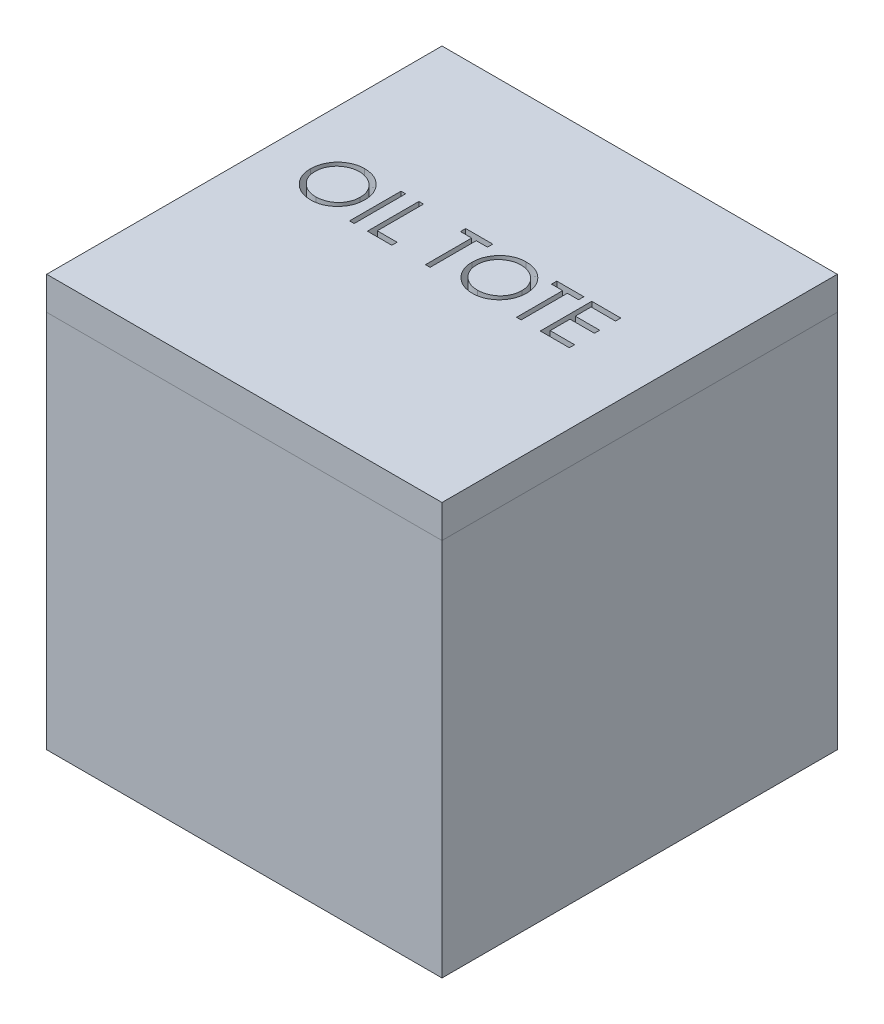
from build123d import *

# Parameters (mm, degrees)
SKETCH1_W           = 1219.2
SKETCH1_H           = 1219.2
BOSS_EXTRUDE1_DEPTH = 1168.4
SKETCH2_W           = 1219.2
SKETCH2_H           = 1219.2
BOSS_EXTRUDE2_DEPTH = 101.6
SKETCH3_W           = 14.246794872
SKETCH3_H           = 158.75
CUT_EXTRUDE1_DEPTH  = 101.6


with BuildPart() as part:
    # Sketch1 → Boss-Extrude1 (new body)
    with BuildSketch(Plane(origin=(0, 0, 0), x_dir=(1, 0, 0), z_dir=(0, 1, 0))):
        Rectangle(SKETCH1_W, SKETCH1_H)
    extrude(amount=BOSS_EXTRUDE1_DEPTH)


with BuildPart() as body_2:
    # Sketch2 → Boss-Extrude2 (new body)
    with BuildSketch(Plane(origin=(0, 1168.4, 0), x_dir=(1, 0, 0), z_dir=(0, 1, 0))):
        Rectangle(SKETCH2_W, SKETCH2_H)
    extrude(amount=BOSS_EXTRUDE2_DEPTH)

    # Sketch3 → Cut-Extrude1 (cut)
    # profile 1 of 7: a face of its own
    with BuildSketch(Plane(origin=(0, 1270, 0), x_dir=(1, 0, 0), z_dir=(0, 1, 0))):
        with BuildLine():
            add(Edge.make_bspline(
                [(-402.10480343, 162.820512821), (-399.165292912, 162.746060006), (-393.391851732, 162.599828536), (-384.906668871, 161.480454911), (-376.806105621, 159.543914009), (-369.024174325, 156.964771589), (-361.653957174, 153.524233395), (-354.639978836, 149.365657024), (-347.998927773, 144.445474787), (-341.820315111, 138.801720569), (-336.166232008, 132.66111391), (-331.184843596, 126.108008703), (-327.01006813, 119.182027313), (-323.581712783, 111.903982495), (-320.892097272, 104.290333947), (-319.036126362, 96.30049168), (-317.850574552, 87.986223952), (-317.711973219, 82.315362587), (-317.641662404, 79.438601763)],
                knots=[0, 0, 0, 0, 1.065120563, 2.091984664, 3.0946048, 4.079830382, 5.057816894, 6.036188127, 7.030412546, 8.04752943, 9.064399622, 10.05169764, 11.02544977, 11.989514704, 12.962713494, 13.945757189, 14.957906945, 16, 16, 16, 16], degree=3))
            add(Edge.make_bspline(
                [(-317.641662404, 79.438601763), (-317.711962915, 76.583031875), (-317.850533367, 70.954372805), (-319.037474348, 62.692866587), (-320.898976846, 54.751252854), (-323.556736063, 47.142789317), (-326.968748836, 39.859449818), (-331.171322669, 32.920398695), (-336.121656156, 26.32336109), (-341.755324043, 20.14060806), (-347.896728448, 14.471079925), (-354.483958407, 9.530830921), (-361.368869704, 5.279772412), (-368.640060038, 1.887798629), (-376.201097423, -0.823284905), (-384.119652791, -2.671707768), (-392.358621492, -3.864012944), (-397.977056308, -4.000924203), (-400.832768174, -4.070512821)],
                knots=[0, 0, 0, 0, 1.043624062, 2.057103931, 3.04512605, 4.022047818, 4.998200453, 5.980619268, 6.982898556, 8.009068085, 9.034988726, 10.034168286, 11.015286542, 11.987931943, 12.962482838, 13.94673481, 14.956375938, 16, 16, 16, 16], degree=3))
            add(Edge.make_bspline(
                [(-400.832768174, -4.070512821), (-403.70951407, -4.00023706), (-409.380346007, -3.861704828), (-417.705061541, -2.67419111), (-425.700516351, -0.817210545), (-433.343845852, 1.836610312), (-440.639312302, 5.266391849), (-447.60118391, 9.448519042), (-454.20151666, 14.410914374), (-460.385588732, 20.042755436), (-466.043855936, 26.173750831), (-470.976870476, 32.743018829), (-475.159938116, 39.621677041), (-478.578203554, 46.828814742), (-481.28441296, 54.329590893), (-483.130667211, 62.174039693), (-484.325190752, 70.317438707), (-484.462842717, 75.862027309), (-484.532688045, 78.675380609)],
                knots=[0, 0, 0, 0, 1.053102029, 2.075944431, 3.073151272, 4.055350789, 5.033113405, 6.020478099, 7.024410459, 8.052272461, 9.079885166, 10.07527673, 11.055994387, 12.023226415, 12.992069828, 13.970394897, 14.97016774, 16, 16, 16, 16], degree=3))
            add(Edge.make_bspline(
                [(-484.532688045, 78.675380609), (-484.508438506, 80.563719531), (-484.460245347, 84.316575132), (-483.880050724, 89.889453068), (-483.038144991, 95.372707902), (-481.831558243, 100.750747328), (-480.253507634, 106.010406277), (-478.391504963, 111.187958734), (-476.117304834, 116.230934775), (-473.546432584, 121.163224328), (-470.67705772, 125.907940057), (-467.50769337, 130.392835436), (-464.149660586, 134.655544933), (-460.468320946, 138.585605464), (-456.58500361, 142.297346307), (-452.436712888, 145.733726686), (-448.04876109, 148.92573339), (-443.402267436, 151.802298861), (-438.611724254, 154.403945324), (-433.673384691, 156.636507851), (-428.654318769, 158.552668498), (-423.531018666, 160.105734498), (-418.317089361, 161.331830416), (-413.001151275, 162.166735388), (-407.58743944, 162.748409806), (-403.94021176, 162.796375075), (-402.10480343, 162.820512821)],
                knots=[0, 0, 0, 0, 1.037015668, 2.060948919, 3.074880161, 4.083647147, 5.086022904, 6.090072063, 7.104153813, 8.122640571, 9.144368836, 10.147691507, 11.138137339, 12.123020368, 13.103399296, 14.087645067, 15.080126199, 16.082011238, 17.087798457, 18.072939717, 19.057185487, 20.037253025, 21.01195951, 21.997135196, 22.992090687, 24, 24, 24, 24], degree=3))
        make_face()
        with BuildLine():
            add(Edge.make_bspline(
                [(-401.405184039, 146.538461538), (-402.911704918, 146.520096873), (-405.910344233, 146.483543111), (-410.368249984, 146.002044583), (-414.767526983, 145.315796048), (-419.109083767, 144.336919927), (-423.374754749, 143.003236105), (-427.604301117, 141.468309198), (-431.759153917, 139.598638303), (-435.825596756, 137.486233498), (-439.767816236, 135.148121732), (-443.487678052, 132.564045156), (-446.99481226, 129.794603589), (-450.280631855, 126.833333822), (-453.335488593, 123.665155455), (-456.21950898, 120.338098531), (-458.817093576, 116.75706633), (-461.197689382, 113.019165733), (-463.328016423, 109.129265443), (-465.222373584, 105.128318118), (-466.771955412, 100.983687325), (-468.035713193, 96.740338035), (-469.083454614, 92.404990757), (-469.7472076, 87.944757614), (-470.23399676, 83.382050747), (-470.268461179, 80.298588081), (-470.285893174, 78.738982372)],
                knots=[0, 0, 0, 0, 1.008559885, 2.007477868, 2.99961109, 3.989939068, 4.984837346, 5.991145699, 7.001802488, 8.033829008, 9.059044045, 10.069351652, 11.065060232, 12.050310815, 13.029377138, 14.011219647, 14.996725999, 15.989392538, 16.977580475, 17.965360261, 18.951710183, 19.937753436, 20.929683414, 21.935841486, 22.955955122, 24, 24, 24, 24], degree=3))
            add(Edge.make_bspline(
                [(-470.285893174, 78.738982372), (-470.228069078, 76.4456245), (-470.114311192, 71.933880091), (-469.118378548, 65.322253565), (-467.584310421, 58.968249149), (-465.322922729, 52.906633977), (-462.494876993, 47.085304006), (-459.001157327, 41.555900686), (-454.861905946, 36.316929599), (-450.16002456, 31.404965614), (-445.020030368, 26.92160235), (-439.562081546, 22.986262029), (-433.844650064, 19.656582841), (-427.852826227, 16.943995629), (-421.618598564, 14.794532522), (-415.101795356, 13.32139461), (-408.345828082, 12.351865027), (-403.740687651, 12.258757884), (-401.405184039, 12.211538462)],
                knots=[0, 0, 0, 0, 1.032063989, 2.030389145, 3.003944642, 3.970395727, 4.937377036, 5.913328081, 6.909231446, 7.93887556, 8.970685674, 9.976071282, 10.964166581, 11.944589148, 12.933237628, 13.927779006, 14.949070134, 16, 16, 16, 16], degree=3))
            add(Edge.make_bspline(
                [(-401.405184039, 12.211538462), (-399.83539593, 12.233105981), (-396.722034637, 12.27588085), (-392.091273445, 12.706713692), (-387.543938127, 13.397587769), (-383.086406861, 14.392299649), (-378.72373863, 15.637226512), (-374.437724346, 17.116219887), (-370.274016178, 18.961403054), (-366.180087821, 21.000113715), (-362.261401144, 23.32422086), (-358.520546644, 25.820594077), (-355.0518147, 28.585956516), (-351.768453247, 31.503228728), (-348.701054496, 34.631231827), (-345.870361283, 37.965899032), (-343.285905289, 41.528278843), (-340.90621346, 45.260509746), (-338.783351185, 49.161054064), (-336.933727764, 53.176507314), (-335.364546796, 57.296981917), (-334.097789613, 61.528421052), (-333.105127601, 65.862788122), (-332.421145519, 70.305886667), (-331.942698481, 74.848828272), (-331.906636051, 77.921496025), (-331.888457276, 79.470402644)],
                knots=[0, 0, 0, 0, 1.047197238, 2.076906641, 3.100256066, 4.114471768, 5.12198147, 6.126382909, 7.136867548, 8.15857795, 9.17633901, 10.174870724, 11.156907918, 12.133735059, 13.104061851, 14.077631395, 15.04955518, 16.038496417, 17.029181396, 18.010275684, 18.986308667, 19.968651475, 20.955262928, 21.950658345, 22.966943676, 24, 24, 24, 24], degree=3))
            add(Edge.make_bspline(
                [(-331.888457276, 79.470402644), (-331.906650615, 81.008713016), (-331.942740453, 84.060235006), (-332.420916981, 88.571493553), (-333.105850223, 92.98262136), (-334.09294448, 97.276300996), (-335.36521931, 101.453626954), (-336.934001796, 105.510675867), (-338.783906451, 109.462561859), (-340.906993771, 113.299517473), (-343.293497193, 116.98137166), (-345.9012718, 120.501195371), (-348.775342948, 123.792887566), (-351.83359479, 126.937711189), (-355.152417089, 129.868594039), (-358.716776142, 132.586508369), (-362.483400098, 135.157046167), (-366.471528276, 137.475955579), (-370.587414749, 139.617458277), (-374.810797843, 141.452200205), (-379.093832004, 143.011221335), (-383.42562567, 144.340955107), (-387.842639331, 145.311962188), (-392.315027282, 146.002663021), (-396.836601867, 146.483375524), (-399.877490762, 146.520041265), (-401.405184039, 146.538461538)],
                knots=[0, 0, 0, 0, 1.02996197, 2.043119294, 3.035359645, 4.018872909, 4.991431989, 5.957985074, 6.929999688, 7.912076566, 8.892894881, 9.867085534, 10.843653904, 11.817741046, 12.803660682, 13.806313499, 14.818574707, 15.856120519, 16.894564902, 17.924820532, 18.937903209, 19.946497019, 20.957711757, 21.963978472, 22.977135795, 24, 24, 24, 24], degree=3))
        make_face(mode=Mode.SUBTRACT)
    # profile 2 of 7: a face of its own
    with BuildSketch(Plane(origin=(0, 1270, 0), x_dir=(1, 0, 0), z_dir=(0, 1, 0))):
        with Locations((-277.954162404, 79.375)):
            Rectangle(SKETCH3_W, SKETCH3_H)
    # profile 3 of 7: a face of its own
    with BuildSketch(Plane(origin=(0, 1270, 0), x_dir=(1, 0, 0), z_dir=(0, 1, 0))):
        Polygon((-230.125636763, 158.75), (-215.878841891, 158.75), (-215.878841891, 16.282051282), (-154.821149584, 16.282051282), (-154.821149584, 0), (-230.125636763, 0), align=None)
    # profile 4 of 7: a face of its own
    with BuildSketch(Plane(origin=(0, 1270, 0), x_dir=(1, 0, 0), z_dir=(0, 1, 0))):
        Polygon((-85.622431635, 142.467948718), (-85.622431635, 158.75), (-2.176918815, 158.75), (-2.176918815, 142.467948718), (-36.776277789, 142.467948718), (-36.776277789, 0), (-51.023072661, 0), (-51.023072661, 142.467948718), align=None)
    # profile 5 of 7: a face of its own
    with BuildSketch(Plane(origin=(0, 1270, 0), x_dir=(1, 0, 0), z_dir=(0, 1, 0))):
        with BuildLine():
            add(Edge.make_bspline(
                [(96.533017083, 162.820512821), (99.472527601, 162.746060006), (105.245968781, 162.599828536), (113.731151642, 161.480454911), (121.831714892, 159.543914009), (129.613646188, 156.964771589), (136.983863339, 153.524233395), (143.997841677, 149.365657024), (150.63889274, 144.445474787), (156.817505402, 138.801720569), (162.471588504, 132.66111391), (167.452976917, 126.108008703), (171.627752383, 119.182027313), (175.056107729, 111.903982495), (177.745723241, 104.290333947), (179.601694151, 96.30049168), (180.787245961, 87.986223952), (180.925847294, 82.315362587), (180.996158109, 79.438601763)],
                knots=[0, 0, 0, 0, 1.065120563, 2.091984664, 3.0946048, 4.079830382, 5.057816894, 6.036188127, 7.030412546, 8.04752943, 9.064399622, 10.05169764, 11.02544977, 11.989514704, 12.962713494, 13.945757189, 14.957906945, 16, 16, 16, 16], degree=3))
            add(Edge.make_bspline(
                [(180.996158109, 79.438601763), (180.925857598, 76.583031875), (180.787287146, 70.954372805), (179.600346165, 62.692866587), (177.738843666, 54.751252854), (175.08108445, 47.142789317), (171.669071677, 39.859449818), (167.466497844, 32.920398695), (162.516164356, 26.32336109), (156.88249647, 20.14060806), (150.741092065, 14.471079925), (144.153862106, 9.530830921), (137.268950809, 5.279772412), (129.997760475, 1.887798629), (122.43672309, -0.823284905), (114.518167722, -2.671707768), (106.279199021, -3.864012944), (100.660764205, -4.000924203), (97.805052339, -4.070512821)],
                knots=[0, 0, 0, 0, 1.043624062, 2.057103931, 3.04512605, 4.022047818, 4.998200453, 5.980619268, 6.982898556, 8.009068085, 9.034988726, 10.034168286, 11.015286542, 11.987931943, 12.962482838, 13.94673481, 14.956375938, 16, 16, 16, 16], degree=3))
            add(Edge.make_bspline(
                [(97.805052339, -4.070512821), (94.928306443, -4.00023706), (89.257474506, -3.861704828), (80.932758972, -2.67419111), (72.937304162, -0.817210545), (65.293974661, 1.836610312), (57.998508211, 5.266391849), (51.036636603, 9.448519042), (44.436303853, 14.410914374), (38.25223178, 20.042755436), (32.593964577, 26.173750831), (27.660950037, 32.743018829), (23.477882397, 39.621677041), (20.059616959, 46.828814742), (17.353407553, 54.329590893), (15.507153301, 62.174039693), (14.312629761, 70.317438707), (14.174977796, 75.862027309), (14.105132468, 78.675380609)],
                knots=[0, 0, 0, 0, 1.053102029, 2.075944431, 3.073151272, 4.055350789, 5.033113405, 6.020478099, 7.024410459, 8.052272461, 9.079885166, 10.07527673, 11.055994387, 12.023226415, 12.992069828, 13.970394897, 14.97016774, 16, 16, 16, 16], degree=3))
            add(Edge.make_bspline(
                [(14.105132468, 78.675380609), (14.129382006, 80.563719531), (14.177575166, 84.316575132), (14.757769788, 89.889453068), (15.599675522, 95.372707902), (16.806262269, 100.750747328), (18.384312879, 106.010406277), (20.24631555, 111.187958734), (22.520515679, 116.230934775), (25.091387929, 121.163224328), (27.960762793, 125.907940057), (31.130127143, 130.392835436), (34.488159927, 134.655544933), (38.169499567, 138.585605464), (42.052816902, 142.297346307), (46.201107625, 145.733726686), (50.589059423, 148.92573339), (55.235553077, 151.802298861), (60.026096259, 154.403945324), (64.964435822, 156.636507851), (69.983501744, 158.552668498), (75.106801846, 160.105734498), (80.320731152, 161.331830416), (85.636669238, 162.166735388), (91.050381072, 162.748409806), (94.697608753, 162.796375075), (96.533017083, 162.820512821)],
                knots=[0, 0, 0, 0, 1.037015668, 2.060948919, 3.074880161, 4.083647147, 5.086022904, 6.090072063, 7.104153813, 8.122640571, 9.144368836, 10.147691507, 11.138137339, 12.123020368, 13.103399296, 14.087645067, 15.080126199, 16.082011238, 17.087798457, 18.072939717, 19.057185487, 20.037253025, 21.01195951, 21.997135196, 22.992090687, 24, 24, 24, 24], degree=3))
        make_face()
        with BuildLine():
            add(Edge.make_bspline(
                [(97.232636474, 146.538461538), (95.726115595, 146.520096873), (92.72747628, 146.483543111), (88.269570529, 146.002044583), (83.87029353, 145.315796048), (79.528736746, 144.336919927), (75.263065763, 143.003236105), (71.033519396, 141.468309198), (66.878666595, 139.598638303), (62.812223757, 137.486233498), (58.870004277, 135.148121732), (55.150142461, 132.564045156), (51.643008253, 129.794603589), (48.357188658, 126.833333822), (45.30233192, 123.665155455), (42.418311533, 120.338098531), (39.820726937, 116.75706633), (37.440131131, 113.019165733), (35.30980409, 109.129265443), (33.415446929, 105.128318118), (31.865865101, 100.983687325), (30.60210732, 96.740338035), (29.554365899, 92.404990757), (28.890612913, 87.944757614), (28.403823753, 83.382050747), (28.369359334, 80.298588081), (28.351927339, 78.738982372)],
                knots=[0, 0, 0, 0, 1.008559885, 2.007477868, 2.99961109, 3.989939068, 4.984837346, 5.991145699, 7.001802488, 8.033829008, 9.059044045, 10.069351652, 11.065060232, 12.050310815, 13.029377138, 14.011219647, 14.996725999, 15.989392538, 16.977580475, 17.965360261, 18.951710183, 19.937753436, 20.929683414, 21.935841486, 22.955955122, 24, 24, 24, 24], degree=3))
            add(Edge.make_bspline(
                [(28.351927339, 78.738982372), (28.409751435, 76.4456245), (28.52350932, 71.933880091), (29.519441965, 65.322253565), (31.053510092, 58.968249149), (33.314897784, 52.906633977), (36.14294352, 47.085304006), (39.636663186, 41.555900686), (43.775914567, 36.316929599), (48.477795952, 31.404965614), (53.617790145, 26.92160235), (59.075738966, 22.986262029), (64.793170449, 19.656582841), (70.784994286, 16.943995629), (77.019221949, 14.794532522), (83.536025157, 13.32139461), (90.291992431, 12.351865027), (94.897132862, 12.258757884), (97.232636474, 12.211538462)],
                knots=[0, 0, 0, 0, 1.032063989, 2.030389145, 3.003944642, 3.970395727, 4.937377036, 5.913328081, 6.909231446, 7.93887556, 8.970685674, 9.976071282, 10.964166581, 11.944589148, 12.933237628, 13.927779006, 14.949070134, 16, 16, 16, 16], degree=3))
            add(Edge.make_bspline(
                [(97.232636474, 12.211538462), (98.802424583, 12.233105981), (101.915785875, 12.27588085), (106.546547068, 12.706713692), (111.093882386, 13.397587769), (115.551413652, 14.392299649), (119.914081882, 15.637226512), (124.200096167, 17.116219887), (128.363804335, 18.961403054), (132.457732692, 21.000113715), (136.376419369, 23.32422086), (140.117273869, 25.820594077), (143.586005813, 28.585956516), (146.869367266, 31.503228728), (149.936766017, 34.631231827), (152.76745923, 37.965899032), (155.351915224, 41.528278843), (157.731607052, 45.260509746), (159.854469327, 49.161054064), (161.704092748, 53.176507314), (163.273273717, 57.296981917), (164.5400309, 61.528421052), (165.532692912, 65.862788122), (166.216674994, 70.305886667), (166.695122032, 74.848828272), (166.731184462, 77.921496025), (166.749363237, 79.470402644)],
                knots=[0, 0, 0, 0, 1.047197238, 2.076906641, 3.100256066, 4.114471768, 5.12198147, 6.126382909, 7.136867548, 8.15857795, 9.17633901, 10.174870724, 11.156907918, 12.133735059, 13.104061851, 14.077631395, 15.04955518, 16.038496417, 17.029181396, 18.010275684, 18.986308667, 19.968651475, 20.955262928, 21.950658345, 22.966943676, 24, 24, 24, 24], degree=3))
            add(Edge.make_bspline(
                [(166.749363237, 79.470402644), (166.731169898, 81.008713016), (166.69508006, 84.060235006), (166.216903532, 88.571493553), (165.53197029, 92.98262136), (164.544876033, 97.276300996), (163.272601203, 101.453626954), (161.703818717, 105.510675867), (159.853914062, 109.462561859), (157.730826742, 113.299517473), (155.34432332, 116.98137166), (152.736548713, 120.501195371), (149.862477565, 123.792887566), (146.804225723, 126.937711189), (143.485403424, 129.868594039), (139.921044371, 132.586508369), (136.154420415, 135.157046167), (132.166292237, 137.475955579), (128.050405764, 139.617458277), (123.82702267, 141.452200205), (119.543988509, 143.011221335), (115.212194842, 144.340955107), (110.795181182, 145.311962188), (106.322793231, 146.002663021), (101.801218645, 146.483375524), (98.760329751, 146.520041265), (97.232636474, 146.538461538)],
                knots=[0, 0, 0, 0, 1.02996197, 2.043119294, 3.035359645, 4.018872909, 4.991431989, 5.957985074, 6.929999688, 7.912076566, 8.892894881, 9.867085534, 10.843653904, 11.817741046, 12.803660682, 13.806313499, 14.818574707, 15.856120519, 16.894564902, 17.924820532, 18.937903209, 19.946497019, 20.957711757, 21.963978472, 22.977135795, 24, 24, 24, 24], degree=3))
        make_face(mode=Mode.SUBTRACT)
    # profile 6 of 7: a face of its own
    with BuildSketch(Plane(origin=(0, 1270, 0), x_dir=(1, 0, 0), z_dir=(0, 1, 0))):
        Polygon((195.24295298, 142.467948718), (195.24295298, 158.75), (278.688465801, 158.75), (278.688465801, 142.467948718), (244.089106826, 142.467948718), (244.089106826, 0), (229.842311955, 0), (229.842311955, 142.467948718), align=None)
    # profile 7 of 7: a face of its own
    with BuildSketch(Plane(origin=(0, 1270, 0), x_dir=(1, 0, 0), z_dir=(0, 1, 0))):
        Polygon((303.111542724, 158.75), (392.662824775, 158.75), (392.662824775, 142.467948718), (317.358337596, 142.467948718), (317.358337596, 93.621794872), (392.662824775, 93.621794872), (392.662824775, 77.33974359), (317.358337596, 77.33974359), (317.358337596, 16.282051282), (392.662824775, 16.282051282), (392.662824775, 0), (303.111542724, 0), align=None)
    extrude(amount=-CUT_EXTRUDE1_DEPTH, mode=Mode.SUBTRACT)


with BuildPart() as cut_extrude1_piece_1:
    # of the separate pieces the step leaves, piece 1, a body of its own (cut_extrude1_pieces)
    add(body_2.part.solids().sort_by_distance((609.6, 1168.4, -609.6))[0])


with BuildPart() as cut_extrude1_piece_2:
    # of the separate pieces the step leaves, piece 2, a body of its own (cut_extrude1_pieces)
    add(body_2.part.solids().sort_by_distance((-331.888457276, 1168.4, -79.470402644))[0])


with BuildPart() as cut_extrude1_piece_3:
    # of the separate pieces the step leaves, piece 3, a body of its own (cut_extrude1_pieces)
    add(body_2.part.solids().sort_by_distance((166.749363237, 1168.4, -79.470402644))[0])


solid = Compound([part.part, cut_extrude1_piece_1.part, cut_extrude1_piece_2.part, cut_extrude1_piece_3.part])
